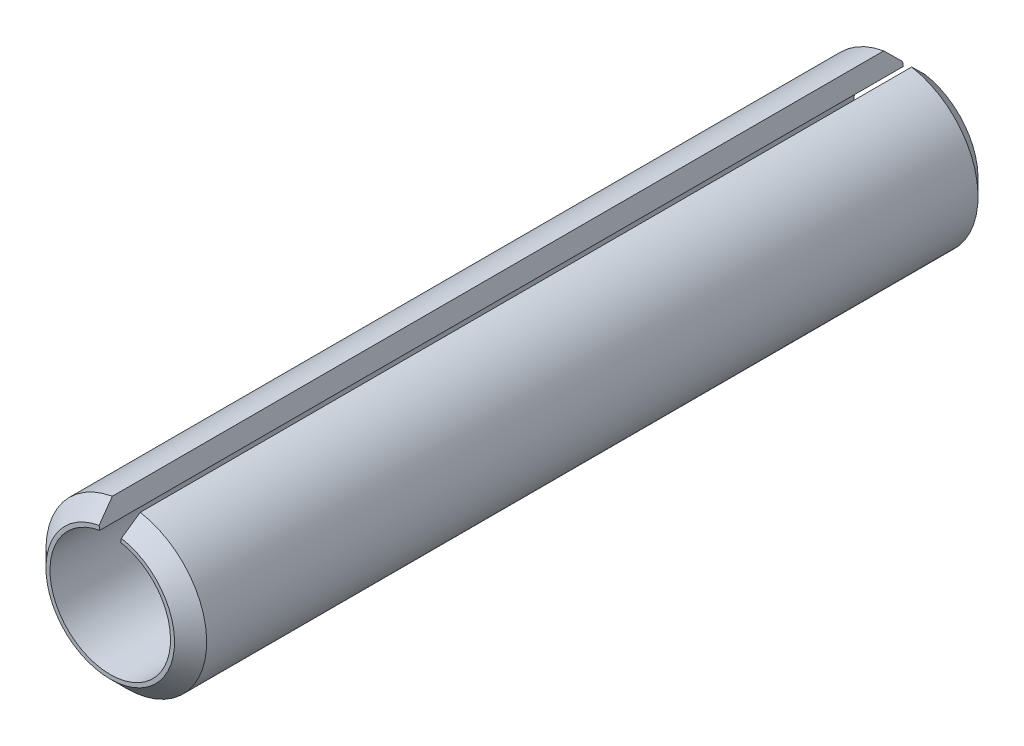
ISO-10303-21;
HEADER;
FILE_DESCRIPTION(('STEP AP214'),'2;1');
FILE_NAME('part.step','',(''),(''),'','','');
FILE_SCHEMA(('AUTOMOTIVE_DESIGN { 1 0 10303 214 1 1 1 1 }'));
ENDSEC;
DATA;
#1=APPLICATION_CONTEXT('core data for automotive mechanical design processes');
#2=APPLICATION_PROTOCOL_DEFINITION('international standard','automotive_design',2000,#1);
#3=PRODUCT_CONTEXT('',#1,'mechanical');
#4=PRODUCT('Part','Part','',(#3));
#5=PRODUCT_RELATED_PRODUCT_CATEGORY('part','',(#4));
#6=PRODUCT_DEFINITION_FORMATION('','',#4);
#7=PRODUCT_DEFINITION_CONTEXT('part definition',#1,'design');
#8=PRODUCT_DEFINITION('design','',#6,#7);
#9=PRODUCT_DEFINITION_SHAPE('','',#8);
#10=(LENGTH_UNIT() NAMED_UNIT(*) SI_UNIT(.MILLI.,.METRE.));
#11=(NAMED_UNIT(*) PLANE_ANGLE_UNIT() SI_UNIT($,.RADIAN.));
#12=(NAMED_UNIT(*) SI_UNIT($,.STERADIAN.) SOLID_ANGLE_UNIT());
#13=UNCERTAINTY_MEASURE_WITH_UNIT(LENGTH_MEASURE(1.E-05),#10,'distance_accuracy_value','');
#14=(GEOMETRIC_REPRESENTATION_CONTEXT(3) GLOBAL_UNCERTAINTY_ASSIGNED_CONTEXT((#13)) GLOBAL_UNIT_ASSIGNED_CONTEXT((#10,
#11,#12)) REPRESENTATION_CONTEXT('',''));
#15=CARTESIAN_POINT('',(0.,0.,0.));
#16=DIRECTION('',(0.,0.,1.));
#17=DIRECTION('',(1.,0.,0.));
#18=AXIS2_PLACEMENT_3D('',#15,#16,#17);
#19=CARTESIAN_POINT('',(0.,0.,10.));
#20=DIRECTION('',(0.,0.,-1.));
#21=DIRECTION('',(-1.,0.,0.));
#22=AXIS2_PLACEMENT_3D('',#19,#20,#21);
#23=CYLINDRICAL_SURFACE('',#22,1.5);
#24=CARTESIAN_POINT('',(0.,0.,-10.));
#25=DIRECTION('',(0.,0.,-1.));
#26=DIRECTION('',(1.,0.,0.));
#27=AXIS2_PLACEMENT_3D('',#24,#25,#26);
#28=CIRCLE('',#27,1.5);
#29=CARTESIAN_POINT('',(0.260472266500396,1.47721162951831,-10.));
#30=VERTEX_POINT('',#29);
#31=CARTESIAN_POINT('',(-0.260472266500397,1.47721162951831,-10.));
#32=VERTEX_POINT('',#31);
#33=EDGE_CURVE('E78',#30,#32,#28,.T.);
#34=ORIENTED_EDGE('',*,*,#33,.T.);
#35=DIRECTION('',(0.,0.,-1.));
#36=VECTOR('',#35,1.);
#37=CARTESIAN_POINT('',(-0.260472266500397,1.47721162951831,10.));
#38=LINE('',#37,#36);
#39=CARTESIAN_POINT('',(-0.260472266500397,1.47721162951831,10.));
#40=VERTEX_POINT('',#39);
#41=EDGE_CURVE('E82',#40,#32,#38,.T.);
#42=ORIENTED_EDGE('',*,*,#41,.F.);
#43=CARTESIAN_POINT('',(0.,0.,10.));
#44=DIRECTION('',(0.,0.,-1.));
#45=DIRECTION('',(1.,0.,0.));
#46=AXIS2_PLACEMENT_3D('',#43,#44,#45);
#47=CIRCLE('',#46,1.5);
#48=CARTESIAN_POINT('',(0.260472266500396,1.47721162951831,10.));
#49=VERTEX_POINT('',#48);
#50=EDGE_CURVE('E98',#49,#40,#47,.T.);
#51=ORIENTED_EDGE('',*,*,#50,.F.);
#52=DIRECTION('',(0.,0.,-1.));
#53=VECTOR('',#52,1.);
#54=CARTESIAN_POINT('',(0.260472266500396,1.47721162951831,10.));
#55=LINE('',#54,#53);
#56=EDGE_CURVE('E94',#49,#30,#55,.T.);
#57=ORIENTED_EDGE('',*,*,#56,.T.);
#58=EDGE_LOOP('',(#34,#42,#51,#57));
#59=FACE_BOUND('',#58,.T.);
#60=ADVANCED_FACE('F24',(#59),#23,.F.);
#61=CARTESIAN_POINT('',(-0.260472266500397,1.47721162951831,10.));
#62=DIRECTION('',(-0.984807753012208,-0.173648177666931,0.));
#63=DIRECTION('',(0.173648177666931,-0.984807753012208,0.));
#64=AXIS2_PLACEMENT_3D('',#61,#62,#63);
#65=PLANE('',#64);
#66=DIRECTION('',(0.,0.,-1.));
#67=VECTOR('',#66,1.);
#68=CARTESIAN_POINT('',(-0.347296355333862,1.96961550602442,10.));
#69=LINE('',#68,#67);
#70=CARTESIAN_POINT('',(-0.347296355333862,1.96961550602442,9.6));
#71=VERTEX_POINT('',#70);
#72=CARTESIAN_POINT('',(-0.347296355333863,1.96961550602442,-9.59999999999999));
#73=VERTEX_POINT('',#72);
#74=EDGE_CURVE('E90',#71,#73,#69,.T.);
#75=ORIENTED_EDGE('',*,*,#74,.F.);
#76=DIRECTION('',(-0.122787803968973,0.696364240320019,-0.707106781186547));
#77=VECTOR('',#76,1.);
#78=CARTESIAN_POINT('',(0.,0.,11.6));
#79=LINE('',#78,#77);
#80=CARTESIAN_POINT('',(-0.27783708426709,1.57569240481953,10.));
#81=VERTEX_POINT('',#80);
#82=EDGE_CURVE('E31',#71,#81,#79,.F.);
#83=ORIENTED_EDGE('',*,*,#82,.T.);
#84=DIRECTION('',(-0.173648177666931,0.984807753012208,0.));
#85=VECTOR('',#84,1.);
#86=CARTESIAN_POINT('',(-0.260472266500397,1.47721162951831,10.));
#87=LINE('',#86,#85);
#88=EDGE_CURVE('E85',#40,#81,#87,.T.);
#89=ORIENTED_EDGE('',*,*,#88,.F.);
#90=ORIENTED_EDGE('',*,*,#41,.T.);
#91=DIRECTION('',(-0.173648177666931,0.984807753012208,0.));
#92=VECTOR('',#91,1.);
#93=CARTESIAN_POINT('',(-0.260472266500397,1.47721162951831,-10.));
#94=LINE('',#93,#92);
#95=CARTESIAN_POINT('',(-0.27783708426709,1.57569240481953,-10.));
#96=VERTEX_POINT('',#95);
#97=EDGE_CURVE('E74',#32,#96,#94,.T.);
#98=ORIENTED_EDGE('',*,*,#97,.T.);
#99=DIRECTION('',(0.122787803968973,-0.696364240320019,-0.707106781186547));
#100=VECTOR('',#99,1.);
#101=CARTESIAN_POINT('',(0.,0.,-11.6));
#102=LINE('',#101,#100);
#103=EDGE_CURVE('E43',#96,#73,#102,.F.);
#104=ORIENTED_EDGE('',*,*,#103,.T.);
#105=EDGE_LOOP('',(#75,#83,#89,#90,#98,#104));
#106=FACE_BOUND('',#105,.T.);
#107=ADVANCED_FACE('F83',(#106),#65,.F.);
#108=CARTESIAN_POINT('',(0.,0.,10.));
#109=DIRECTION('',(0.,0.,-1.));
#110=DIRECTION('',(-1.,0.,0.));
#111=AXIS2_PLACEMENT_3D('',#108,#109,#110);
#112=CYLINDRICAL_SURFACE('',#111,2.);
#113=DIRECTION('',(0.,0.,-1.));
#114=VECTOR('',#113,1.);
#115=CARTESIAN_POINT('',(0.347296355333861,1.96961550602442,10.));
#116=LINE('',#115,#114);
#117=CARTESIAN_POINT('',(0.347296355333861,1.96961550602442,9.6));
#118=VERTEX_POINT('',#117);
#119=CARTESIAN_POINT('',(0.347296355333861,1.96961550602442,-9.6));
#120=VERTEX_POINT('',#119);
#121=EDGE_CURVE('E104',#118,#120,#116,.T.);
#122=ORIENTED_EDGE('',*,*,#121,.F.);
#123=CARTESIAN_POINT('',(0.,0.,9.6));
#124=DIRECTION('',(0.,0.,1.));
#125=DIRECTION('',(1.,0.,0.));
#126=AXIS2_PLACEMENT_3D('',#123,#124,#125);
#127=CIRCLE('',#126,2.);
#128=EDGE_CURVE('E117',#118,#71,#127,.F.);
#129=ORIENTED_EDGE('',*,*,#128,.T.);
#130=ORIENTED_EDGE('',*,*,#74,.T.);
#131=CARTESIAN_POINT('',(0.,0.,-9.6));
#132=DIRECTION('',(0.,0.,1.));
#133=DIRECTION('',(1.,0.,0.));
#134=AXIS2_PLACEMENT_3D('',#131,#132,#133);
#135=CIRCLE('',#134,2.);
#136=EDGE_CURVE('E114',#73,#120,#135,.T.);
#137=ORIENTED_EDGE('',*,*,#136,.T.);
#138=EDGE_LOOP('',(#122,#129,#130,#137));
#139=FACE_BOUND('',#138,.T.);
#140=ADVANCED_FACE('F131',(#139),#112,.T.);
#141=CARTESIAN_POINT('',(0.260472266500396,1.47721162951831,10.));
#142=DIRECTION('',(0.984807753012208,-0.173648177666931,0.));
#143=DIRECTION('',(0.173648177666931,0.984807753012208,0.));
#144=AXIS2_PLACEMENT_3D('',#141,#142,#143);
#145=PLANE('',#144);
#146=DIRECTION('',(-0.173648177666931,-0.984807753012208,0.));
#147=VECTOR('',#146,1.);
#148=CARTESIAN_POINT('',(0.260472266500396,1.47721162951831,10.));
#149=LINE('',#148,#147);
#150=CARTESIAN_POINT('',(0.27783708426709,1.57569240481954,10.));
#151=VERTEX_POINT('',#150);
#152=EDGE_CURVE('E101',#151,#49,#149,.T.);
#153=ORIENTED_EDGE('',*,*,#152,.F.);
#154=DIRECTION('',(-0.122787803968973,-0.696364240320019,0.707106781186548));
#155=VECTOR('',#154,1.);
#156=CARTESIAN_POINT('',(0.,0.,11.6));
#157=LINE('',#156,#155);
#158=EDGE_CURVE('E112',#151,#118,#157,.F.);
#159=ORIENTED_EDGE('',*,*,#158,.T.);
#160=ORIENTED_EDGE('',*,*,#121,.T.);
#161=DIRECTION('',(0.122787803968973,0.696364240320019,0.707106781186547));
#162=VECTOR('',#161,1.);
#163=CARTESIAN_POINT('',(0.,0.,-11.6));
#164=LINE('',#163,#162);
#165=CARTESIAN_POINT('',(0.277837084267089,1.57569240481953,-10.));
#166=VERTEX_POINT('',#165);
#167=EDGE_CURVE('E110',#120,#166,#164,.F.);
#168=ORIENTED_EDGE('',*,*,#167,.T.);
#169=DIRECTION('',(-0.173648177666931,-0.984807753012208,0.));
#170=VECTOR('',#169,1.);
#171=CARTESIAN_POINT('',(0.260472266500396,1.47721162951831,-10.));
#172=LINE('',#171,#170);
#173=EDGE_CURVE('E79',#166,#30,#172,.T.);
#174=ORIENTED_EDGE('',*,*,#173,.T.);
#175=ORIENTED_EDGE('',*,*,#56,.F.);
#176=EDGE_LOOP('',(#153,#159,#160,#168,#174,#175));
#177=FACE_BOUND('',#176,.T.);
#178=ADVANCED_FACE('F129',(#177),#145,.F.);
#179=CARTESIAN_POINT('',(0.,0.,10.));
#180=DIRECTION('',(0.,0.,1.));
#181=DIRECTION('',(1.,0.,0.));
#182=AXIS2_PLACEMENT_3D('',#179,#180,#181);
#183=PLANE('',#182);
#184=ORIENTED_EDGE('',*,*,#88,.T.);
#185=CARTESIAN_POINT('',(0.,0.,10.));
#186=DIRECTION('',(0.,0.,1.));
#187=DIRECTION('',(1.,0.,0.));
#188=AXIS2_PLACEMENT_3D('',#185,#186,#187);
#189=CIRCLE('',#188,1.6);
#190=EDGE_CURVE('E89',#81,#151,#189,.T.);
#191=ORIENTED_EDGE('',*,*,#190,.T.);
#192=ORIENTED_EDGE('',*,*,#152,.T.);
#193=ORIENTED_EDGE('',*,*,#50,.T.);
#194=EDGE_LOOP('',(#184,#191,#192,#193));
#195=FACE_BOUND('',#194,.T.);
#196=ADVANCED_FACE('F124',(#195),#183,.T.);
#197=CARTESIAN_POINT('',(0.,0.,-10.));
#198=DIRECTION('',(0.,0.,1.));
#199=DIRECTION('',(1.,0.,0.));
#200=AXIS2_PLACEMENT_3D('',#197,#198,#199);
#201=PLANE('',#200);
#202=ORIENTED_EDGE('',*,*,#173,.F.);
#203=CARTESIAN_POINT('',(0.,0.,-10.));
#204=DIRECTION('',(0.,0.,1.));
#205=DIRECTION('',(1.,0.,0.));
#206=AXIS2_PLACEMENT_3D('',#203,#204,#205);
#207=CIRCLE('',#206,1.6);
#208=EDGE_CURVE('E11',#166,#96,#207,.F.);
#209=ORIENTED_EDGE('',*,*,#208,.T.);
#210=ORIENTED_EDGE('',*,*,#97,.F.);
#211=ORIENTED_EDGE('',*,*,#33,.F.);
#212=EDGE_LOOP('',(#202,#209,#210,#211));
#213=FACE_BOUND('',#212,.T.);
#214=ADVANCED_FACE('F76',(#213),#201,.F.);
#215=CARTESIAN_POINT('',(0.,0.,10.));
#216=DIRECTION('',(0.,0.,-1.));
#217=DIRECTION('',(-1.,0.,0.));
#218=AXIS2_PLACEMENT_3D('',#215,#216,#217);
#219=CONICAL_SURFACE('',#218,1.6,0.785398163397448);
#220=ORIENTED_EDGE('',*,*,#82,.F.);
#221=ORIENTED_EDGE('',*,*,#128,.F.);
#222=ORIENTED_EDGE('',*,*,#158,.F.);
#223=ORIENTED_EDGE('',*,*,#190,.F.);
#224=EDGE_LOOP('',(#220,#221,#222,#223));
#225=FACE_BOUND('',#224,.T.);
#226=ADVANCED_FACE('F126',(#225),#219,.T.);
#227=CARTESIAN_POINT('',(0.,0.,-9.6));
#228=DIRECTION('',(0.,0.,1.));
#229=DIRECTION('',(1.,0.,0.));
#230=AXIS2_PLACEMENT_3D('',#227,#228,#229);
#231=CONICAL_SURFACE('',#230,2.,0.785398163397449);
#232=ORIENTED_EDGE('',*,*,#103,.F.);
#233=ORIENTED_EDGE('',*,*,#208,.F.);
#234=ORIENTED_EDGE('',*,*,#167,.F.);
#235=ORIENTED_EDGE('',*,*,#136,.F.);
#236=EDGE_LOOP('',(#232,#233,#234,#235));
#237=FACE_BOUND('',#236,.T.);
#238=ADVANCED_FACE('F134',(#237),#231,.T.);
#239=CLOSED_SHELL('',(#60,#107,#140,#178,#196,#214,#226,#238));
#240=MANIFOLD_SOLID_BREP('B2',#239);
#241=ADVANCED_BREP_SHAPE_REPRESENTATION('',(#18,#240),#14);
#242=SHAPE_DEFINITION_REPRESENTATION(#9,#241);
ENDSEC;
END-ISO-10303-21;
